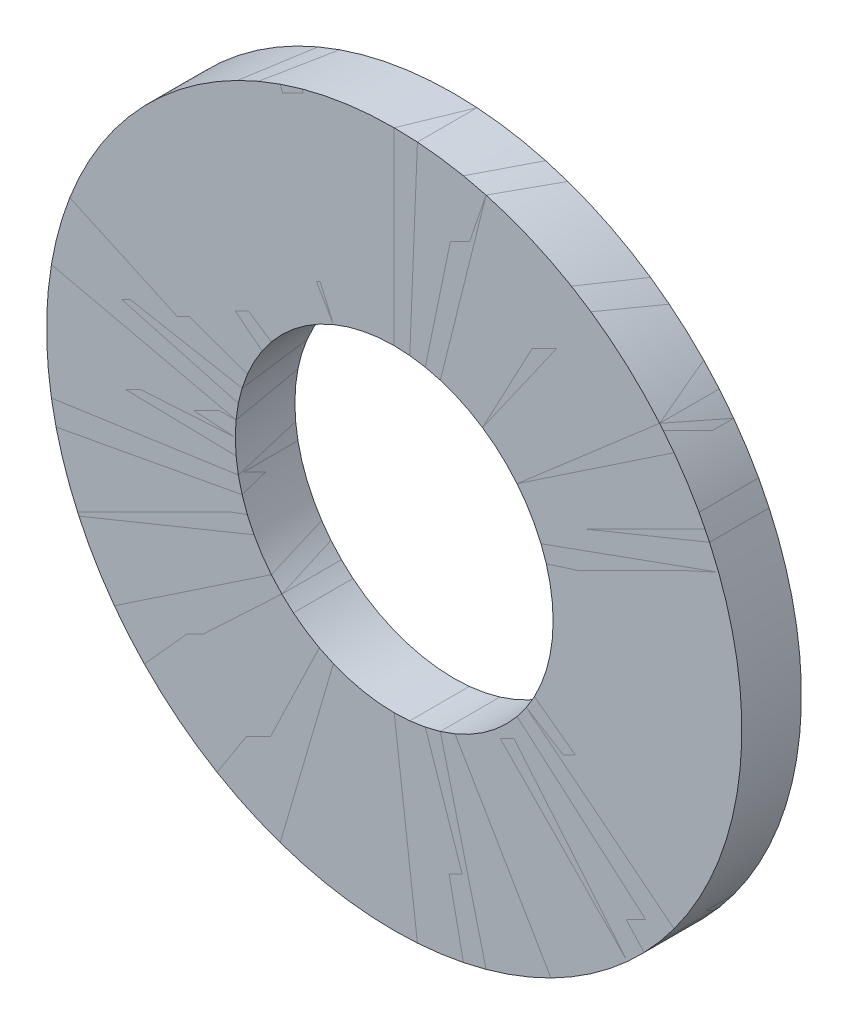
ISO-10303-21;
HEADER;
FILE_DESCRIPTION(('STEP AP214'),'2;1');
FILE_NAME('part.step','',(''),(''),'','','');
FILE_SCHEMA(('AUTOMOTIVE_DESIGN { 1 0 10303 214 1 1 1 1 }'));
ENDSEC;
DATA;
#1=APPLICATION_CONTEXT('core data for automotive mechanical design processes');
#2=APPLICATION_PROTOCOL_DEFINITION('international standard','automotive_design',2000,#1);
#3=PRODUCT_CONTEXT('',#1,'mechanical');
#4=PRODUCT('Part','Part','',(#3));
#5=PRODUCT_RELATED_PRODUCT_CATEGORY('part','',(#4));
#6=PRODUCT_DEFINITION_FORMATION('','',#4);
#7=PRODUCT_DEFINITION_CONTEXT('part definition',#1,'design');
#8=PRODUCT_DEFINITION('design','',#6,#7);
#9=PRODUCT_DEFINITION_SHAPE('','',#8);
#10=(LENGTH_UNIT() NAMED_UNIT(*) SI_UNIT(.MILLI.,.METRE.));
#11=(NAMED_UNIT(*) PLANE_ANGLE_UNIT() SI_UNIT($,.RADIAN.));
#12=(NAMED_UNIT(*) SI_UNIT($,.STERADIAN.) SOLID_ANGLE_UNIT());
#13=UNCERTAINTY_MEASURE_WITH_UNIT(LENGTH_MEASURE(1.E-05),#10,'distance_accuracy_value','');
#14=(GEOMETRIC_REPRESENTATION_CONTEXT(3) GLOBAL_UNCERTAINTY_ASSIGNED_CONTEXT((#13)) GLOBAL_UNIT_ASSIGNED_CONTEXT((#10,
#11,#12)) REPRESENTATION_CONTEXT('',''));
#15=CARTESIAN_POINT('',(0.,0.,0.));
#16=DIRECTION('',(0.,0.,1.));
#17=DIRECTION('',(1.,0.,0.));
#18=AXIS2_PLACEMENT_3D('',#15,#16,#17);
#19=CARTESIAN_POINT('',(0.,0.,0.));
#20=DIRECTION('',(0.,0.,-1.));
#21=DIRECTION('',(0.,1.,0.));
#22=AXIS2_PLACEMENT_3D('',#19,#20,#21);
#23=CYLINDRICAL_SURFACE('',#22,3.2);
#24=CARTESIAN_POINT('',(0.,0.,1.2));
#25=DIRECTION('',(0.,0.,-1.));
#26=DIRECTION('',(0.,1.,0.));
#27=AXIS2_PLACEMENT_3D('',#24,#25,#26);
#28=CIRCLE('',#27,3.2);
#29=CARTESIAN_POINT('',(0.,3.2,1.2));
#30=VERTEX_POINT('',#29);
#31=EDGE_CURVE('P0_E10',#30,#30,#28,.T.);
#32=ORIENTED_EDGE('',*,*,#31,.F.);
#33=EDGE_LOOP('',(#32));
#34=FACE_BOUND('',#33,.T.);
#35=CARTESIAN_POINT('',(0.,0.,0.));
#36=DIRECTION('',(0.,0.,-1.));
#37=DIRECTION('',(0.,1.,0.));
#38=AXIS2_PLACEMENT_3D('',#35,#36,#37);
#39=CIRCLE('',#38,3.2);
#40=CARTESIAN_POINT('',(0.,3.2,0.));
#41=VERTEX_POINT('',#40);
#42=EDGE_CURVE('P0_E367',#41,#41,#39,.T.);
#43=ORIENTED_EDGE('',*,*,#42,.T.);
#44=EDGE_LOOP('',(#43));
#45=FACE_BOUND('',#44,.T.);
#46=ADVANCED_FACE('P0_F353',(#34,#45),#23,.F.);
#47=CARTESIAN_POINT('',(7.,0.,1.2));
#48=DIRECTION('',(0.,0.,1.));
#49=DIRECTION('',(0.,-1.,0.));
#50=AXIS2_PLACEMENT_3D('',#47,#48,#49);
#51=PLANE('',#50);
#52=ORIENTED_EDGE('',*,*,#31,.T.);
#53=EDGE_LOOP('',(#52));
#54=FACE_BOUND('',#53,.T.);
#55=CARTESIAN_POINT('',(0.,0.,1.2));
#56=DIRECTION('',(0.,0.,-1.));
#57=DIRECTION('',(0.,1.,0.));
#58=AXIS2_PLACEMENT_3D('',#55,#56,#57);
#59=CIRCLE('',#58,7.);
#60=CARTESIAN_POINT('',(0.,7.,1.2));
#61=VERTEX_POINT('',#60);
#62=EDGE_CURVE('P0_E359',#61,#61,#59,.T.);
#63=ORIENTED_EDGE('',*,*,#62,.F.);
#64=EDGE_LOOP('',(#63));
#65=FACE_BOUND('',#64,.T.);
#66=ADVANCED_FACE('P0_F382',(#54,#65),#51,.T.);
#67=CARTESIAN_POINT('',(0.,0.,0.));
#68=DIRECTION('',(0.,0.,-1.));
#69=DIRECTION('',(0.,1.,0.));
#70=AXIS2_PLACEMENT_3D('',#67,#68,#69);
#71=CYLINDRICAL_SURFACE('',#70,7.);
#72=ORIENTED_EDGE('',*,*,#62,.T.);
#73=EDGE_LOOP('',(#72));
#74=FACE_BOUND('',#73,.T.);
#75=CARTESIAN_POINT('',(0.,0.,0.));
#76=DIRECTION('',(0.,0.,-1.));
#77=DIRECTION('',(0.,1.,0.));
#78=AXIS2_PLACEMENT_3D('',#75,#76,#77);
#79=CIRCLE('',#78,7.);
#80=CARTESIAN_POINT('',(0.,7.,0.));
#81=VERTEX_POINT('',#80);
#82=EDGE_CURVE('P0_E363',#81,#81,#79,.T.);
#83=ORIENTED_EDGE('',*,*,#82,.F.);
#84=EDGE_LOOP('',(#83));
#85=FACE_BOUND('',#84,.T.);
#86=ADVANCED_FACE('P0_F376',(#74,#85),#71,.T.);
#87=CARTESIAN_POINT('',(3.2,0.,0.));
#88=DIRECTION('',(0.,0.,-1.));
#89=DIRECTION('',(0.,1.,0.));
#90=AXIS2_PLACEMENT_3D('',#87,#88,#89);
#91=PLANE('',#90);
#92=ORIENTED_EDGE('',*,*,#82,.T.);
#93=EDGE_LOOP('',(#92));
#94=FACE_BOUND('',#93,.T.);
#95=ORIENTED_EDGE('',*,*,#42,.F.);
#96=EDGE_LOOP('',(#95));
#97=FACE_BOUND('',#96,.T.);
#98=ADVANCED_FACE('P0_F374',(#94,#97),#91,.T.);
#99=CLOSED_SHELL('',(#46,#66,#86,#98));
#100=MANIFOLD_SOLID_BREP('P0_B2',#99);
#101=CARTESIAN_POINT('',(0.,0.,0.));
#102=DIRECTION('',(0.,0.,-1.));
#103=DIRECTION('',(0.,1.,0.));
#104=AXIS2_PLACEMENT_3D('',#101,#102,#103);
#105=CYLINDRICAL_SURFACE('',#104,3.2);
#106=CARTESIAN_POINT('',(0.,0.,1.2));
#107=DIRECTION('',(0.,0.,-1.));
#108=DIRECTION('',(0.,1.,0.));
#109=AXIS2_PLACEMENT_3D('',#106,#107,#108);
#110=CIRCLE('',#109,3.2);
#111=CARTESIAN_POINT('',(0.,3.2,1.2));
#112=VERTEX_POINT('',#111);
#113=EDGE_CURVE('P1_E9',#112,#112,#110,.T.);
#114=ORIENTED_EDGE('',*,*,#113,.F.);
#115=EDGE_LOOP('',(#114));
#116=FACE_BOUND('',#115,.T.);
#117=CARTESIAN_POINT('',(0.,0.,0.));
#118=DIRECTION('',(0.,0.,-1.));
#119=DIRECTION('',(0.,1.,0.));
#120=AXIS2_PLACEMENT_3D('',#117,#118,#119);
#121=CIRCLE('',#120,3.2);
#122=CARTESIAN_POINT('',(0.,3.2,0.));
#123=VERTEX_POINT('',#122);
#124=EDGE_CURVE('P1_E27',#123,#123,#121,.T.);
#125=ORIENTED_EDGE('',*,*,#124,.T.);
#126=EDGE_LOOP('',(#125));
#127=FACE_BOUND('',#126,.T.);
#128=ADVANCED_FACE('P1_F13',(#116,#127),#105,.F.);
#129=CARTESIAN_POINT('',(7.,0.,1.2));
#130=DIRECTION('',(0.,0.,1.));
#131=DIRECTION('',(0.,-1.,0.));
#132=AXIS2_PLACEMENT_3D('',#129,#130,#131);
#133=PLANE('',#132);
#134=ORIENTED_EDGE('',*,*,#113,.T.);
#135=EDGE_LOOP('',(#134));
#136=FACE_BOUND('',#135,.T.);
#137=CARTESIAN_POINT('',(0.,0.,1.2));
#138=DIRECTION('',(0.,0.,-1.));
#139=DIRECTION('',(0.,1.,0.));
#140=AXIS2_PLACEMENT_3D('',#137,#138,#139);
#141=CIRCLE('',#140,7.);
#142=CARTESIAN_POINT('',(0.,7.,1.2));
#143=VERTEX_POINT('',#142);
#144=EDGE_CURVE('P1_E19',#143,#143,#141,.T.);
#145=ORIENTED_EDGE('',*,*,#144,.F.);
#146=EDGE_LOOP('',(#145));
#147=FACE_BOUND('',#146,.T.);
#148=ADVANCED_FACE('P1_F38',(#136,#147),#133,.T.);
#149=CARTESIAN_POINT('',(0.,0.,0.));
#150=DIRECTION('',(0.,0.,-1.));
#151=DIRECTION('',(0.,1.,0.));
#152=AXIS2_PLACEMENT_3D('',#149,#150,#151);
#153=CYLINDRICAL_SURFACE('',#152,7.);
#154=ORIENTED_EDGE('',*,*,#144,.T.);
#155=EDGE_LOOP('',(#154));
#156=FACE_BOUND('',#155,.T.);
#157=CARTESIAN_POINT('',(0.,0.,0.));
#158=DIRECTION('',(0.,0.,-1.));
#159=DIRECTION('',(0.,1.,0.));
#160=AXIS2_PLACEMENT_3D('',#157,#158,#159);
#161=CIRCLE('',#160,7.);
#162=CARTESIAN_POINT('',(0.,7.,0.));
#163=VERTEX_POINT('',#162);
#164=EDGE_CURVE('P1_E23',#163,#163,#161,.T.);
#165=ORIENTED_EDGE('',*,*,#164,.F.);
#166=EDGE_LOOP('',(#165));
#167=FACE_BOUND('',#166,.T.);
#168=ADVANCED_FACE('P1_F35',(#156,#167),#153,.T.);
#169=CARTESIAN_POINT('',(3.2,0.,0.));
#170=DIRECTION('',(0.,0.,-1.));
#171=DIRECTION('',(0.,1.,0.));
#172=AXIS2_PLACEMENT_3D('',#169,#170,#171);
#173=PLANE('',#172);
#174=ORIENTED_EDGE('',*,*,#164,.T.);
#175=EDGE_LOOP('',(#174));
#176=FACE_BOUND('',#175,.T.);
#177=ORIENTED_EDGE('',*,*,#124,.F.);
#178=EDGE_LOOP('',(#177));
#179=FACE_BOUND('',#178,.T.);
#180=ADVANCED_FACE('P1_F34',(#176,#179),#173,.T.);
#181=CLOSED_SHELL('',(#128,#148,#168,#180));
#182=MANIFOLD_SOLID_BREP('P1_B1',#181);
#183=ADVANCED_BREP_SHAPE_REPRESENTATION('',(#18,#100,#182),#14);
#184=SHAPE_DEFINITION_REPRESENTATION(#9,#183);
ENDSEC;
END-ISO-10303-21;
